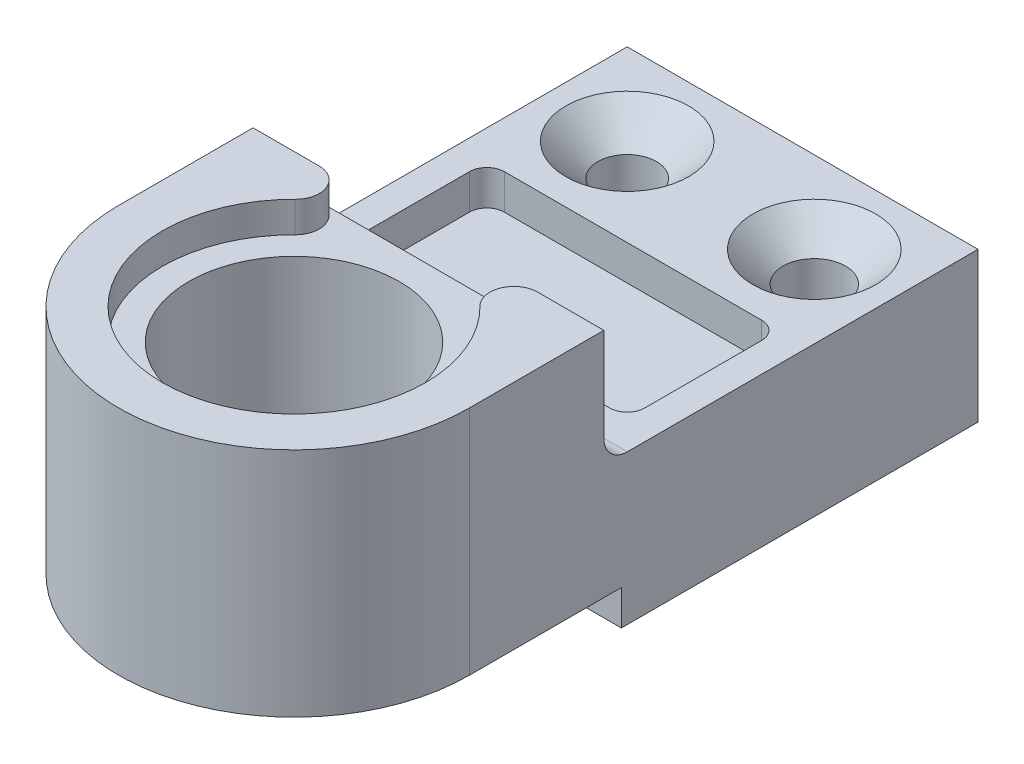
ISO-10303-21;
HEADER;
FILE_DESCRIPTION(('STEP AP214'),'2;1');
FILE_NAME('part.step','',(''),(''),'','','');
FILE_SCHEMA(('AUTOMOTIVE_DESIGN { 1 0 10303 214 1 1 1 1 }'));
ENDSEC;
DATA;
#1=APPLICATION_CONTEXT('core data for automotive mechanical design processes');
#2=APPLICATION_PROTOCOL_DEFINITION('international standard','automotive_design',2000,#1);
#3=PRODUCT_CONTEXT('',#1,'mechanical');
#4=PRODUCT('Part','Part','',(#3));
#5=PRODUCT_RELATED_PRODUCT_CATEGORY('part','',(#4));
#6=PRODUCT_DEFINITION_FORMATION('','',#4);
#7=PRODUCT_DEFINITION_CONTEXT('part definition',#1,'design');
#8=PRODUCT_DEFINITION('design','',#6,#7);
#9=PRODUCT_DEFINITION_SHAPE('','',#8);
#10=(LENGTH_UNIT() NAMED_UNIT(*) SI_UNIT(.MILLI.,.METRE.));
#11=(NAMED_UNIT(*) PLANE_ANGLE_UNIT() SI_UNIT($,.RADIAN.));
#12=(NAMED_UNIT(*) SI_UNIT($,.STERADIAN.) SOLID_ANGLE_UNIT());
#13=UNCERTAINTY_MEASURE_WITH_UNIT(LENGTH_MEASURE(1.E-05),#10,'distance_accuracy_value','');
#14=(GEOMETRIC_REPRESENTATION_CONTEXT(3) GLOBAL_UNCERTAINTY_ASSIGNED_CONTEXT((#13)) GLOBAL_UNIT_ASSIGNED_CONTEXT((#10,
#11,#12)) REPRESENTATION_CONTEXT('',''));
#15=CARTESIAN_POINT('',(0.,0.,0.));
#16=DIRECTION('',(0.,0.,1.));
#17=DIRECTION('',(1.,0.,0.));
#18=AXIS2_PLACEMENT_3D('',#15,#16,#17);
#19=CARTESIAN_POINT('',(0.,0.,0.));
#20=DIRECTION('',(0.,-1.,0.));
#21=DIRECTION('',(0.,0.,-1.));
#22=AXIS2_PLACEMENT_3D('',#19,#20,#21);
#23=CYLINDRICAL_SURFACE('',#22,9.);
#24=CARTESIAN_POINT('',(0.,7.37,0.));
#25=DIRECTION('',(0.,-1.,0.));
#26=DIRECTION('',(0.,0.,-1.));
#27=AXIS2_PLACEMENT_3D('',#24,#25,#26);
#28=CIRCLE('',#27,9.);
#29=CARTESIAN_POINT('',(0.,7.37,-9.));
#30=VERTEX_POINT('',#29);
#31=EDGE_CURVE('E194',#30,#30,#28,.T.);
#32=ORIENTED_EDGE('',*,*,#31,.F.);
#33=EDGE_LOOP('',(#32));
#34=FACE_BOUND('',#33,.T.);
#35=CARTESIAN_POINT('',(0.,-7.17,0.));
#36=DIRECTION('',(0.,-1.,0.));
#37=DIRECTION('',(0.,0.,-1.));
#38=AXIS2_PLACEMENT_3D('',#35,#36,#37);
#39=CIRCLE('',#38,9.);
#40=CARTESIAN_POINT('',(0.,-7.17,-9.));
#41=VERTEX_POINT('',#40);
#42=EDGE_CURVE('E19',#41,#41,#39,.T.);
#43=ORIENTED_EDGE('',*,*,#42,.T.);
#44=EDGE_LOOP('',(#43));
#45=FACE_BOUND('',#44,.T.);
#46=ADVANCED_FACE('F15',(#34,#45),#23,.F.);
#47=CARTESIAN_POINT('',(0.,-3.,-22.5));
#48=DIRECTION('',(0.,1.,0.));
#49=DIRECTION('',(0.,0.,1.));
#50=AXIS2_PLACEMENT_3D('',#47,#48,#49);
#51=PLANE('',#50);
#52=CARTESIAN_POINT('',(-11.,-3.,-27.5));
#53=DIRECTION('',(0.,-1.,0.));
#54=DIRECTION('',(0.,0.,-1.));
#55=AXIS2_PLACEMENT_3D('',#52,#53,#54);
#56=CIRCLE('',#55,1.49999999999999);
#57=CARTESIAN_POINT('',(-11.,-3.,-29.));
#58=VERTEX_POINT('',#57);
#59=CARTESIAN_POINT('',(-12.5,-3.,-27.5));
#60=VERTEX_POINT('',#59);
#61=EDGE_CURVE('E200',#58,#60,#56,.F.);
#62=ORIENTED_EDGE('',*,*,#61,.T.);
#63=DIRECTION('',(0.,0.,1.));
#64=VECTOR('',#63,1.);
#65=CARTESIAN_POINT('',(-12.5,-3.,-27.5));
#66=LINE('',#65,#64);
#67=CARTESIAN_POINT('',(-12.5,-3.,-17.5));
#68=VERTEX_POINT('',#67);
#69=EDGE_CURVE('E197',#60,#68,#66,.T.);
#70=ORIENTED_EDGE('',*,*,#69,.T.);
#71=CARTESIAN_POINT('',(-11.,-3.,-17.5));
#72=DIRECTION('',(0.,-1.,0.));
#73=DIRECTION('',(0.,0.,-1.));
#74=AXIS2_PLACEMENT_3D('',#71,#72,#73);
#75=CIRCLE('',#74,1.50000000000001);
#76=CARTESIAN_POINT('',(-11.,-3.,-16.));
#77=VERTEX_POINT('',#76);
#78=EDGE_CURVE('E183',#68,#77,#75,.F.);
#79=ORIENTED_EDGE('',*,*,#78,.T.);
#80=DIRECTION('',(1.,0.,0.));
#81=VECTOR('',#80,1.);
#82=CARTESIAN_POINT('',(-11.,-3.,-16.));
#83=LINE('',#82,#81);
#84=CARTESIAN_POINT('',(11.,-3.,-16.));
#85=VERTEX_POINT('',#84);
#86=EDGE_CURVE('E235',#77,#85,#83,.T.);
#87=ORIENTED_EDGE('',*,*,#86,.T.);
#88=CARTESIAN_POINT('',(11.,-3.,-17.5));
#89=DIRECTION('',(0.,-1.,0.));
#90=DIRECTION('',(0.,0.,-1.));
#91=AXIS2_PLACEMENT_3D('',#88,#89,#90);
#92=CIRCLE('',#91,1.5);
#93=CARTESIAN_POINT('',(12.5,-3.,-17.5));
#94=VERTEX_POINT('',#93);
#95=EDGE_CURVE('E346',#85,#94,#92,.F.);
#96=ORIENTED_EDGE('',*,*,#95,.T.);
#97=DIRECTION('',(0.,0.,-1.));
#98=VECTOR('',#97,1.);
#99=CARTESIAN_POINT('',(12.5,-3.,-17.5));
#100=LINE('',#99,#98);
#101=CARTESIAN_POINT('',(12.5,-3.,-27.5));
#102=VERTEX_POINT('',#101);
#103=EDGE_CURVE('E238',#94,#102,#100,.T.);
#104=ORIENTED_EDGE('',*,*,#103,.T.);
#105=CARTESIAN_POINT('',(11.,-3.,-27.5));
#106=DIRECTION('',(0.,-1.,0.));
#107=DIRECTION('',(0.,0.,-1.));
#108=AXIS2_PLACEMENT_3D('',#105,#106,#107);
#109=CIRCLE('',#108,1.49999999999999);
#110=CARTESIAN_POINT('',(11.,-3.,-29.));
#111=VERTEX_POINT('',#110);
#112=EDGE_CURVE('E350',#102,#111,#109,.F.);
#113=ORIENTED_EDGE('',*,*,#112,.T.);
#114=DIRECTION('',(-1.,0.,0.));
#115=VECTOR('',#114,1.);
#116=CARTESIAN_POINT('',(11.,-3.,-29.));
#117=LINE('',#116,#115);
#118=EDGE_CURVE('E243',#111,#58,#117,.T.);
#119=ORIENTED_EDGE('',*,*,#118,.T.);
#120=EDGE_LOOP('',(#62,#70,#79,#87,#96,#104,#113,#119));
#121=FACE_BOUND('',#120,.T.);
#122=ADVANCED_FACE('F198',(#121),#51,.T.);
#123=CARTESIAN_POINT('',(0.,-9.80000000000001,-22.5));
#124=DIRECTION('',(0.,1.,0.));
#125=DIRECTION('',(0.,0.,1.));
#126=AXIS2_PLACEMENT_3D('',#123,#124,#125);
#127=PLANE('',#126);
#128=CARTESIAN_POINT('',(-11.,-9.80000000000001,-27.5));
#129=DIRECTION('',(0.,1.,0.));
#130=DIRECTION('',(0.,0.,1.));
#131=AXIS2_PLACEMENT_3D('',#128,#129,#130);
#132=CIRCLE('',#131,1.49999999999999);
#133=CARTESIAN_POINT('',(-12.5,-9.80000000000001,-27.5));
#134=VERTEX_POINT('',#133);
#135=CARTESIAN_POINT('',(-11.,-9.80000000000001,-29.));
#136=VERTEX_POINT('',#135);
#137=EDGE_CURVE('E343',#134,#136,#132,.F.);
#138=ORIENTED_EDGE('',*,*,#137,.T.);
#139=DIRECTION('',(-1.,0.,0.));
#140=VECTOR('',#139,1.);
#141=CARTESIAN_POINT('',(-11.,-9.80000000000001,-29.));
#142=LINE('',#141,#140);
#143=CARTESIAN_POINT('',(11.,-9.80000000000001,-29.));
#144=VERTEX_POINT('',#143);
#145=EDGE_CURVE('E231',#136,#144,#142,.F.);
#146=ORIENTED_EDGE('',*,*,#145,.T.);
#147=CARTESIAN_POINT('',(11.,-9.80000000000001,-27.5));
#148=DIRECTION('',(0.,1.,0.));
#149=DIRECTION('',(0.,0.,1.));
#150=AXIS2_PLACEMENT_3D('',#147,#148,#149);
#151=CIRCLE('',#150,1.49999999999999);
#152=CARTESIAN_POINT('',(12.5,-9.80000000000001,-27.5));
#153=VERTEX_POINT('',#152);
#154=EDGE_CURVE('E341',#144,#153,#151,.F.);
#155=ORIENTED_EDGE('',*,*,#154,.T.);
#156=DIRECTION('',(0.,0.,-1.));
#157=VECTOR('',#156,1.);
#158=CARTESIAN_POINT('',(12.5,-9.80000000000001,-27.5));
#159=LINE('',#158,#157);
#160=CARTESIAN_POINT('',(12.5,-9.80000000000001,-17.5));
#161=VERTEX_POINT('',#160);
#162=EDGE_CURVE('E227',#153,#161,#159,.F.);
#163=ORIENTED_EDGE('',*,*,#162,.T.);
#164=CARTESIAN_POINT('',(11.,-9.80000000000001,-17.5));
#165=DIRECTION('',(0.,1.,0.));
#166=DIRECTION('',(0.,0.,1.));
#167=AXIS2_PLACEMENT_3D('',#164,#165,#166);
#168=CIRCLE('',#167,1.5);
#169=CARTESIAN_POINT('',(11.,-9.80000000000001,-16.));
#170=VERTEX_POINT('',#169);
#171=EDGE_CURVE('E339',#161,#170,#168,.F.);
#172=ORIENTED_EDGE('',*,*,#171,.T.);
#173=DIRECTION('',(1.,0.,0.));
#174=VECTOR('',#173,1.);
#175=CARTESIAN_POINT('',(11.,-9.80000000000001,-16.));
#176=LINE('',#175,#174);
#177=CARTESIAN_POINT('',(-11.,-9.80000000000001,-16.));
#178=VERTEX_POINT('',#177);
#179=EDGE_CURVE('E223',#170,#178,#176,.F.);
#180=ORIENTED_EDGE('',*,*,#179,.T.);
#181=CARTESIAN_POINT('',(-11.,-9.80000000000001,-17.5));
#182=DIRECTION('',(0.,1.,0.));
#183=DIRECTION('',(0.,0.,1.));
#184=AXIS2_PLACEMENT_3D('',#181,#182,#183);
#185=CIRCLE('',#184,1.50000000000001);
#186=CARTESIAN_POINT('',(-12.5,-9.80000000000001,-17.5));
#187=VERTEX_POINT('',#186);
#188=EDGE_CURVE('E336',#178,#187,#185,.F.);
#189=ORIENTED_EDGE('',*,*,#188,.T.);
#190=DIRECTION('',(0.,0.,1.));
#191=VECTOR('',#190,1.);
#192=CARTESIAN_POINT('',(-12.5,-9.80000000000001,-17.5));
#193=LINE('',#192,#191);
#194=EDGE_CURVE('E218',#187,#134,#193,.F.);
#195=ORIENTED_EDGE('',*,*,#194,.T.);
#196=EDGE_LOOP('',(#138,#146,#155,#163,#172,#180,#189,#195));
#197=FACE_BOUND('',#196,.T.);
#198=ADVANCED_FACE('F598',(#197),#127,.F.);
#199=CARTESIAN_POINT('',(-8.,0.,-36.5));
#200=DIRECTION('',(0.,-1.,0.));
#201=DIRECTION('',(0.,0.,-1.));
#202=AXIS2_PLACEMENT_3D('',#199,#200,#201);
#203=CYLINDRICAL_SURFACE('',#202,2.50227702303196);
#204=CARTESIAN_POINT('',(-8.,-2.74772297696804,-36.5));
#205=DIRECTION('',(0.,1.,0.));
#206=DIRECTION('',(0.,0.,1.));
#207=AXIS2_PLACEMENT_3D('',#204,#205,#206);
#208=CIRCLE('',#207,2.50227702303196);
#209=CARTESIAN_POINT('',(-8.,-2.74772297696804,-33.997722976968));
#210=VERTEX_POINT('',#209);
#211=EDGE_CURVE('E345',#210,#210,#208,.T.);
#212=ORIENTED_EDGE('',*,*,#211,.T.);
#213=EDGE_LOOP('',(#212));
#214=FACE_BOUND('',#213,.T.);
#215=CARTESIAN_POINT('',(-8.,-10.052277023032,-36.5));
#216=DIRECTION('',(0.,-1.,0.));
#217=DIRECTION('',(1.,0.,0.));
#218=AXIS2_PLACEMENT_3D('',#215,#216,#217);
#219=CIRCLE('',#218,2.50227702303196);
#220=CARTESIAN_POINT('',(-5.49772297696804,-10.052277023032,-36.5));
#221=VERTEX_POINT('',#220);
#222=EDGE_CURVE('E221',#221,#221,#219,.T.);
#223=ORIENTED_EDGE('',*,*,#222,.T.);
#224=EDGE_LOOP('',(#223));
#225=FACE_BOUND('',#224,.T.);
#226=ADVANCED_FACE('F594',(#214,#225),#203,.F.);
#227=CARTESIAN_POINT('',(8.,0.,-36.5));
#228=DIRECTION('',(0.,-1.,0.));
#229=DIRECTION('',(0.,0.,-1.));
#230=AXIS2_PLACEMENT_3D('',#227,#228,#229);
#231=CYLINDRICAL_SURFACE('',#230,2.67376518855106);
#232=CARTESIAN_POINT('',(8.,-2.57623481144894,-36.5));
#233=DIRECTION('',(0.,1.,0.));
#234=DIRECTION('',(0.,0.,1.));
#235=AXIS2_PLACEMENT_3D('',#232,#233,#234);
#236=CIRCLE('',#235,2.67376518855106);
#237=CARTESIAN_POINT('',(8.,-2.57623481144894,-33.8262348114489));
#238=VERTEX_POINT('',#237);
#239=EDGE_CURVE('E237',#238,#238,#236,.T.);
#240=ORIENTED_EDGE('',*,*,#239,.T.);
#241=EDGE_LOOP('',(#240));
#242=FACE_BOUND('',#241,.T.);
#243=CARTESIAN_POINT('',(8.,-10.2237651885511,-36.5));
#244=DIRECTION('',(0.,-1.,0.));
#245=DIRECTION('',(0.,0.,-1.));
#246=AXIS2_PLACEMENT_3D('',#243,#244,#245);
#247=CIRCLE('',#246,2.67376518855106);
#248=CARTESIAN_POINT('',(8.,-10.2237651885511,-39.1737651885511));
#249=VERTEX_POINT('',#248);
#250=EDGE_CURVE('E335',#249,#249,#247,.T.);
#251=ORIENTED_EDGE('',*,*,#250,.T.);
#252=EDGE_LOOP('',(#251));
#253=FACE_BOUND('',#252,.T.);
#254=ADVANCED_FACE('F364',(#242,#253),#231,.F.);
#255=CARTESIAN_POINT('',(0.,-7.17,0.));
#256=DIRECTION('',(0.,1.,0.));
#257=DIRECTION('',(0.,0.,1.));
#258=AXIS2_PLACEMENT_3D('',#255,#256,#257);
#259=PLANE('',#258);
#260=ORIENTED_EDGE('',*,*,#42,.F.);
#261=EDGE_LOOP('',(#260));
#262=FACE_BOUND('',#261,.T.);
#263=CARTESIAN_POINT('',(0.,-7.17,0.));
#264=DIRECTION('',(0.,1.,0.));
#265=DIRECTION('',(0.,0.,1.));
#266=AXIS2_PLACEMENT_3D('',#263,#264,#265);
#267=CIRCLE('',#266,11.25);
#268=CARTESIAN_POINT('',(0.,-7.17,11.25));
#269=VERTEX_POINT('',#268);
#270=EDGE_CURVE('E332',#269,#269,#267,.F.);
#271=ORIENTED_EDGE('',*,*,#270,.T.);
#272=EDGE_LOOP('',(#271));
#273=FACE_BOUND('',#272,.T.);
#274=ADVANCED_FACE('F360',(#262,#273),#259,.F.);
#275=CARTESIAN_POINT('',(0.,7.37,-2.35276534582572));
#276=DIRECTION('',(0.,1.,0.));
#277=DIRECTION('',(0.,0.,1.));
#278=AXIS2_PLACEMENT_3D('',#275,#276,#277);
#279=PLANE('',#278);
#280=ORIENTED_EDGE('',*,*,#31,.T.);
#281=EDGE_LOOP('',(#280));
#282=FACE_BOUND('',#281,.T.);
#283=DIRECTION('',(-1.,0.,0.));
#284=VECTOR('',#283,1.);
#285=CARTESIAN_POINT('',(-15.,7.37,-11.5));
#286=LINE('',#285,#284);
#287=CARTESIAN_POINT('',(-9.34384469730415,7.37,-11.5));
#288=VERTEX_POINT('',#287);
#289=CARTESIAN_POINT('',(9.34384469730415,7.37,-11.5));
#290=VERTEX_POINT('',#289);
#291=EDGE_CURVE('E213',#288,#290,#286,.F.);
#292=ORIENTED_EDGE('',*,*,#291,.F.);
#293=CARTESIAN_POINT('',(-9.34384469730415,7.37,-9.45615530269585));
#294=DIRECTION('',(0.,-1.,0.));
#295=DIRECTION('',(0.,0.,-1.));
#296=AXIS2_PLACEMENT_3D('',#293,#294,#295);
#297=CIRCLE('',#296,2.04384469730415);
#298=CARTESIAN_POINT('',(-7.90728756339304,7.37,-8.00233112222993));
#299=VERTEX_POINT('',#298);
#300=EDGE_CURVE('E330',#299,#288,#297,.F.);
#301=ORIENTED_EDGE('',*,*,#300,.F.);
#302=CARTESIAN_POINT('',(0.,7.37,0.));
#303=DIRECTION('',(0.,-1.,0.));
#304=DIRECTION('',(0.,0.,-1.));
#305=AXIS2_PLACEMENT_3D('',#302,#303,#304);
#306=CIRCLE('',#305,11.25);
#307=CARTESIAN_POINT('',(7.90728756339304,7.37,-8.00233112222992));
#308=VERTEX_POINT('',#307);
#309=EDGE_CURVE('E323',#299,#308,#306,.F.);
#310=ORIENTED_EDGE('',*,*,#309,.T.);
#311=CARTESIAN_POINT('',(9.34384469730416,7.37,-9.45615530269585));
#312=DIRECTION('',(0.,-1.,0.));
#313=DIRECTION('',(0.,0.,-1.));
#314=AXIS2_PLACEMENT_3D('',#311,#312,#313);
#315=CIRCLE('',#314,2.04384469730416);
#316=EDGE_CURVE('E327',#290,#308,#315,.F.);
#317=ORIENTED_EDGE('',*,*,#316,.F.);
#318=EDGE_LOOP('',(#292,#301,#310,#317));
#319=FACE_BOUND('',#318,.T.);
#320=ADVANCED_FACE('F363',(#282,#319),#279,.T.);
#321=CARTESIAN_POINT('',(-11.,0.,-17.5));
#322=DIRECTION('',(0.,-1.,0.));
#323=DIRECTION('',(0.,0.,-1.));
#324=AXIS2_PLACEMENT_3D('',#321,#322,#323);
#325=CYLINDRICAL_SURFACE('',#324,1.50000000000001);
#326=DIRECTION('',(0.,1.,0.));
#327=VECTOR('',#326,1.);
#328=CARTESIAN_POINT('',(-12.5,0.,-17.5));
#329=LINE('',#328,#327);
#330=CARTESIAN_POINT('',(-12.5,0.,-17.5));
#331=VERTEX_POINT('',#330);
#332=EDGE_CURVE('E187',#68,#331,#329,.T.);
#333=ORIENTED_EDGE('',*,*,#332,.T.);
#334=CARTESIAN_POINT('',(-11.,0.,-17.5));
#335=DIRECTION('',(0.,-1.,0.));
#336=DIRECTION('',(0.,0.,-1.));
#337=AXIS2_PLACEMENT_3D('',#334,#335,#336);
#338=CIRCLE('',#337,1.50000000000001);
#339=CARTESIAN_POINT('',(-11.,0.,-16.));
#340=VERTEX_POINT('',#339);
#341=EDGE_CURVE('E320',#340,#331,#338,.T.);
#342=ORIENTED_EDGE('',*,*,#341,.F.);
#343=DIRECTION('',(0.,1.,0.));
#344=VECTOR('',#343,1.);
#345=CARTESIAN_POINT('',(-11.,0.,-16.));
#346=LINE('',#345,#344);
#347=EDGE_CURVE('E190',#340,#77,#346,.F.);
#348=ORIENTED_EDGE('',*,*,#347,.T.);
#349=ORIENTED_EDGE('',*,*,#78,.F.);
#350=EDGE_LOOP('',(#333,#342,#348,#349));
#351=FACE_BOUND('',#350,.T.);
#352=ADVANCED_FACE('F185',(#351),#325,.F.);
#353=CARTESIAN_POINT('',(-12.5,0.,-27.5));
#354=DIRECTION('',(-1.,0.,0.));
#355=DIRECTION('',(0.,0.,1.));
#356=AXIS2_PLACEMENT_3D('',#353,#354,#355);
#357=PLANE('',#356);
#358=DIRECTION('',(0.,-1.,0.));
#359=VECTOR('',#358,1.);
#360=CARTESIAN_POINT('',(-12.5,0.,-27.5));
#361=LINE('',#360,#359);
#362=CARTESIAN_POINT('',(-12.5,0.,-27.5));
#363=VERTEX_POINT('',#362);
#364=EDGE_CURVE('E203',#60,#363,#361,.F.);
#365=ORIENTED_EDGE('',*,*,#364,.T.);
#366=DIRECTION('',(0.,0.,1.));
#367=VECTOR('',#366,1.);
#368=CARTESIAN_POINT('',(-12.5,0.,-17.0086711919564));
#369=LINE('',#368,#367);
#370=EDGE_CURVE('E207',#331,#363,#369,.F.);
#371=ORIENTED_EDGE('',*,*,#370,.F.);
#372=ORIENTED_EDGE('',*,*,#332,.F.);
#373=ORIENTED_EDGE('',*,*,#69,.F.);
#374=EDGE_LOOP('',(#365,#371,#372,#373));
#375=FACE_BOUND('',#374,.T.);
#376=ADVANCED_FACE('F205',(#375),#357,.F.);
#377=CARTESIAN_POINT('',(-11.,0.,-27.5));
#378=DIRECTION('',(0.,-1.,0.));
#379=DIRECTION('',(0.,0.,-1.));
#380=AXIS2_PLACEMENT_3D('',#377,#378,#379);
#381=CYLINDRICAL_SURFACE('',#380,1.49999999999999);
#382=DIRECTION('',(0.,1.,0.));
#383=VECTOR('',#382,1.);
#384=CARTESIAN_POINT('',(-11.,0.,-29.));
#385=LINE('',#384,#383);
#386=CARTESIAN_POINT('',(-11.,0.,-29.));
#387=VERTEX_POINT('',#386);
#388=EDGE_CURVE('E245',#58,#387,#385,.T.);
#389=ORIENTED_EDGE('',*,*,#388,.T.);
#390=CARTESIAN_POINT('',(-11.,0.,-27.5));
#391=DIRECTION('',(0.,-1.,0.));
#392=DIRECTION('',(0.,0.,-1.));
#393=AXIS2_PLACEMENT_3D('',#390,#391,#392);
#394=CIRCLE('',#393,1.49999999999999);
#395=EDGE_CURVE('E317',#363,#387,#394,.T.);
#396=ORIENTED_EDGE('',*,*,#395,.F.);
#397=ORIENTED_EDGE('',*,*,#364,.F.);
#398=ORIENTED_EDGE('',*,*,#61,.F.);
#399=EDGE_LOOP('',(#389,#396,#397,#398));
#400=FACE_BOUND('',#399,.T.);
#401=ADVANCED_FACE('F552',(#400),#381,.F.);
#402=CARTESIAN_POINT('',(11.,0.,-29.));
#403=DIRECTION('',(0.,0.,-1.));
#404=DIRECTION('',(-1.,0.,0.));
#405=AXIS2_PLACEMENT_3D('',#402,#403,#404);
#406=PLANE('',#405);
#407=DIRECTION('',(0.,-1.,0.));
#408=VECTOR('',#407,1.);
#409=CARTESIAN_POINT('',(11.,0.,-29.));
#410=LINE('',#409,#408);
#411=CARTESIAN_POINT('',(11.,0.,-29.));
#412=VERTEX_POINT('',#411);
#413=EDGE_CURVE('E244',#111,#412,#410,.F.);
#414=ORIENTED_EDGE('',*,*,#413,.T.);
#415=DIRECTION('',(1.,0.,0.));
#416=VECTOR('',#415,1.);
#417=CARTESIAN_POINT('',(0.,0.,-29.));
#418=LINE('',#417,#416);
#419=EDGE_CURVE('E316',#387,#412,#418,.T.);
#420=ORIENTED_EDGE('',*,*,#419,.F.);
#421=ORIENTED_EDGE('',*,*,#388,.F.);
#422=ORIENTED_EDGE('',*,*,#118,.F.);
#423=EDGE_LOOP('',(#414,#420,#421,#422));
#424=FACE_BOUND('',#423,.T.);
#425=ADVANCED_FACE('F554',(#424),#406,.F.);
#426=CARTESIAN_POINT('',(11.,0.,-27.5));
#427=DIRECTION('',(0.,-1.,0.));
#428=DIRECTION('',(0.,0.,-1.));
#429=AXIS2_PLACEMENT_3D('',#426,#427,#428);
#430=CYLINDRICAL_SURFACE('',#429,1.49999999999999);
#431=DIRECTION('',(0.,1.,0.));
#432=VECTOR('',#431,1.);
#433=CARTESIAN_POINT('',(12.5,0.,-27.5));
#434=LINE('',#433,#432);
#435=CARTESIAN_POINT('',(12.5,0.,-27.5));
#436=VERTEX_POINT('',#435);
#437=EDGE_CURVE('E242',#102,#436,#434,.T.);
#438=ORIENTED_EDGE('',*,*,#437,.T.);
#439=CARTESIAN_POINT('',(11.,0.,-27.5));
#440=DIRECTION('',(0.,-1.,0.));
#441=DIRECTION('',(0.,0.,-1.));
#442=AXIS2_PLACEMENT_3D('',#439,#440,#441);
#443=CIRCLE('',#442,1.49999999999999);
#444=EDGE_CURVE('E313',#412,#436,#443,.T.);
#445=ORIENTED_EDGE('',*,*,#444,.F.);
#446=ORIENTED_EDGE('',*,*,#413,.F.);
#447=ORIENTED_EDGE('',*,*,#112,.F.);
#448=EDGE_LOOP('',(#438,#445,#446,#447));
#449=FACE_BOUND('',#448,.T.);
#450=ADVANCED_FACE('F572',(#449),#430,.F.);
#451=CARTESIAN_POINT('',(12.5,0.,-17.5));
#452=DIRECTION('',(1.,0.,0.));
#453=DIRECTION('',(0.,0.,-1.));
#454=AXIS2_PLACEMENT_3D('',#451,#452,#453);
#455=PLANE('',#454);
#456=DIRECTION('',(0.,-1.,0.));
#457=VECTOR('',#456,1.);
#458=CARTESIAN_POINT('',(12.5,0.,-17.5));
#459=LINE('',#458,#457);
#460=CARTESIAN_POINT('',(12.5,0.,-17.5));
#461=VERTEX_POINT('',#460);
#462=EDGE_CURVE('E241',#94,#461,#459,.F.);
#463=ORIENTED_EDGE('',*,*,#462,.T.);
#464=DIRECTION('',(0.,0.,1.));
#465=VECTOR('',#464,1.);
#466=CARTESIAN_POINT('',(12.5,0.,-17.0086711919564));
#467=LINE('',#466,#465);
#468=EDGE_CURVE('E312',#436,#461,#467,.T.);
#469=ORIENTED_EDGE('',*,*,#468,.F.);
#470=ORIENTED_EDGE('',*,*,#437,.F.);
#471=ORIENTED_EDGE('',*,*,#103,.F.);
#472=EDGE_LOOP('',(#463,#469,#470,#471));
#473=FACE_BOUND('',#472,.T.);
#474=ADVANCED_FACE('F570',(#473),#455,.F.);
#475=CARTESIAN_POINT('',(11.,0.,-17.5));
#476=DIRECTION('',(0.,-1.,0.));
#477=DIRECTION('',(0.,0.,-1.));
#478=AXIS2_PLACEMENT_3D('',#475,#476,#477);
#479=CYLINDRICAL_SURFACE('',#478,1.5);
#480=DIRECTION('',(0.,1.,0.));
#481=VECTOR('',#480,1.);
#482=CARTESIAN_POINT('',(11.,0.,-16.));
#483=LINE('',#482,#481);
#484=CARTESIAN_POINT('',(11.,0.,-16.));
#485=VERTEX_POINT('',#484);
#486=EDGE_CURVE('E349',#85,#485,#483,.T.);
#487=ORIENTED_EDGE('',*,*,#486,.T.);
#488=CARTESIAN_POINT('',(11.,0.,-17.5));
#489=DIRECTION('',(0.,-1.,0.));
#490=DIRECTION('',(0.,0.,-1.));
#491=AXIS2_PLACEMENT_3D('',#488,#489,#490);
#492=CIRCLE('',#491,1.5);
#493=EDGE_CURVE('E309',#461,#485,#492,.T.);
#494=ORIENTED_EDGE('',*,*,#493,.F.);
#495=ORIENTED_EDGE('',*,*,#462,.F.);
#496=ORIENTED_EDGE('',*,*,#95,.F.);
#497=EDGE_LOOP('',(#487,#494,#495,#496));
#498=FACE_BOUND('',#497,.T.);
#499=ADVANCED_FACE('F567',(#498),#479,.F.);
#500=CARTESIAN_POINT('',(-11.,0.,-16.));
#501=DIRECTION('',(0.,0.,1.));
#502=DIRECTION('',(1.,0.,0.));
#503=AXIS2_PLACEMENT_3D('',#500,#501,#502);
#504=PLANE('',#503);
#505=ORIENTED_EDGE('',*,*,#347,.F.);
#506=DIRECTION('',(1.,0.,0.));
#507=VECTOR('',#506,1.);
#508=CARTESIAN_POINT('',(0.,0.,-16.));
#509=LINE('',#508,#507);
#510=EDGE_CURVE('E308',#485,#340,#509,.F.);
#511=ORIENTED_EDGE('',*,*,#510,.F.);
#512=ORIENTED_EDGE('',*,*,#486,.F.);
#513=ORIENTED_EDGE('',*,*,#86,.F.);
#514=EDGE_LOOP('',(#505,#511,#512,#513));
#515=FACE_BOUND('',#514,.T.);
#516=ADVANCED_FACE('F561',(#515),#504,.F.);
#517=CARTESIAN_POINT('',(8.,0.,-36.5));
#518=DIRECTION('',(0.,1.,0.));
#519=DIRECTION('',(0.,0.,1.));
#520=AXIS2_PLACEMENT_3D('',#517,#518,#519);
#521=CONICAL_SURFACE('',#520,5.25,0.785398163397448);
#522=CARTESIAN_POINT('',(8.,0.,-36.5));
#523=DIRECTION('',(0.,1.,0.));
#524=DIRECTION('',(0.,0.,1.));
#525=AXIS2_PLACEMENT_3D('',#522,#523,#524);
#526=CIRCLE('',#525,5.25);
#527=CARTESIAN_POINT('',(8.,0.,-31.25));
#528=VERTEX_POINT('',#527);
#529=EDGE_CURVE('E305',#528,#528,#526,.F.);
#530=ORIENTED_EDGE('',*,*,#529,.F.);
#531=EDGE_LOOP('',(#530));
#532=FACE_BOUND('',#531,.T.);
#533=ORIENTED_EDGE('',*,*,#239,.F.);
#534=EDGE_LOOP('',(#533));
#535=FACE_BOUND('',#534,.T.);
#536=ADVANCED_FACE('F608',(#532,#535),#521,.F.);
#537=CARTESIAN_POINT('',(-8.,0.,-36.5));
#538=DIRECTION('',(0.,1.,0.));
#539=DIRECTION('',(0.,0.,1.));
#540=AXIS2_PLACEMENT_3D('',#537,#538,#539);
#541=CONICAL_SURFACE('',#540,5.25,0.785398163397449);
#542=CARTESIAN_POINT('',(-8.,0.,-36.5));
#543=DIRECTION('',(0.,1.,0.));
#544=DIRECTION('',(0.,0.,1.));
#545=AXIS2_PLACEMENT_3D('',#542,#543,#544);
#546=CIRCLE('',#545,5.25);
#547=CARTESIAN_POINT('',(-8.,0.,-31.25));
#548=VERTEX_POINT('',#547);
#549=EDGE_CURVE('E301',#548,#548,#546,.F.);
#550=ORIENTED_EDGE('',*,*,#549,.F.);
#551=EDGE_LOOP('',(#550));
#552=FACE_BOUND('',#551,.T.);
#553=ORIENTED_EDGE('',*,*,#211,.F.);
#554=EDGE_LOOP('',(#553));
#555=FACE_BOUND('',#554,.T.);
#556=ADVANCED_FACE('F611',(#552,#555),#541,.F.);
#557=CARTESIAN_POINT('',(-11.,-12.8,-27.5));
#558=DIRECTION('',(0.,1.,0.));
#559=DIRECTION('',(0.,0.,1.));
#560=AXIS2_PLACEMENT_3D('',#557,#558,#559);
#561=CYLINDRICAL_SURFACE('',#560,1.49999999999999);
#562=DIRECTION('',(0.,1.,0.));
#563=VECTOR('',#562,1.);
#564=CARTESIAN_POINT('',(-12.5,-12.8,-27.5));
#565=LINE('',#564,#563);
#566=CARTESIAN_POINT('',(-12.5,-12.8,-27.5));
#567=VERTEX_POINT('',#566);
#568=EDGE_CURVE('E338',#134,#567,#565,.F.);
#569=ORIENTED_EDGE('',*,*,#568,.T.);
#570=CARTESIAN_POINT('',(-11.,-12.8,-27.5));
#571=DIRECTION('',(0.,1.,0.));
#572=DIRECTION('',(0.,0.,1.));
#573=AXIS2_PLACEMENT_3D('',#570,#571,#572);
#574=CIRCLE('',#573,1.49999999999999);
#575=CARTESIAN_POINT('',(-11.,-12.8,-29.));
#576=VERTEX_POINT('',#575);
#577=EDGE_CURVE('E298',#567,#576,#574,.F.);
#578=ORIENTED_EDGE('',*,*,#577,.T.);
#579=DIRECTION('',(0.,1.,0.));
#580=VECTOR('',#579,1.);
#581=CARTESIAN_POINT('',(-11.,-12.8,-29.));
#582=LINE('',#581,#580);
#583=EDGE_CURVE('E234',#576,#136,#582,.T.);
#584=ORIENTED_EDGE('',*,*,#583,.T.);
#585=ORIENTED_EDGE('',*,*,#137,.F.);
#586=EDGE_LOOP('',(#569,#578,#584,#585));
#587=FACE_BOUND('',#586,.T.);
#588=ADVANCED_FACE('F614',(#587),#561,.F.);
#589=CARTESIAN_POINT('',(-11.,-12.8,-29.));
#590=DIRECTION('',(0.,0.,-1.));
#591=DIRECTION('',(-1.,0.,0.));
#592=AXIS2_PLACEMENT_3D('',#589,#590,#591);
#593=PLANE('',#592);
#594=ORIENTED_EDGE('',*,*,#583,.F.);
#595=DIRECTION('',(1.,0.,0.));
#596=VECTOR('',#595,1.);
#597=CARTESIAN_POINT('',(0.,-12.8,-29.));
#598=LINE('',#597,#596);
#599=CARTESIAN_POINT('',(11.,-12.8,-29.));
#600=VERTEX_POINT('',#599);
#601=EDGE_CURVE('E297',#576,#600,#598,.T.);
#602=ORIENTED_EDGE('',*,*,#601,.T.);
#603=DIRECTION('',(0.,1.,0.));
#604=VECTOR('',#603,1.);
#605=CARTESIAN_POINT('',(11.,-12.8,-29.));
#606=LINE('',#605,#604);
#607=EDGE_CURVE('E233',#600,#144,#606,.T.);
#608=ORIENTED_EDGE('',*,*,#607,.T.);
#609=ORIENTED_EDGE('',*,*,#145,.F.);
#610=EDGE_LOOP('',(#594,#602,#608,#609));
#611=FACE_BOUND('',#610,.T.);
#612=ADVANCED_FACE('F702',(#611),#593,.F.);
#613=CARTESIAN_POINT('',(11.,-12.8,-27.5));
#614=DIRECTION('',(0.,1.,0.));
#615=DIRECTION('',(0.,0.,1.));
#616=AXIS2_PLACEMENT_3D('',#613,#614,#615);
#617=CYLINDRICAL_SURFACE('',#616,1.49999999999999);
#618=ORIENTED_EDGE('',*,*,#607,.F.);
#619=CARTESIAN_POINT('',(11.,-12.8,-27.5));
#620=DIRECTION('',(0.,1.,0.));
#621=DIRECTION('',(0.,0.,1.));
#622=AXIS2_PLACEMENT_3D('',#619,#620,#621);
#623=CIRCLE('',#622,1.49999999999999);
#624=CARTESIAN_POINT('',(12.5,-12.8,-27.5));
#625=VERTEX_POINT('',#624);
#626=EDGE_CURVE('E295',#600,#625,#623,.F.);
#627=ORIENTED_EDGE('',*,*,#626,.T.);
#628=DIRECTION('',(0.,1.,0.));
#629=VECTOR('',#628,1.);
#630=CARTESIAN_POINT('',(12.5,-12.8,-27.5));
#631=LINE('',#630,#629);
#632=EDGE_CURVE('E230',#625,#153,#631,.T.);
#633=ORIENTED_EDGE('',*,*,#632,.T.);
#634=ORIENTED_EDGE('',*,*,#154,.F.);
#635=EDGE_LOOP('',(#618,#627,#633,#634));
#636=FACE_BOUND('',#635,.T.);
#637=ADVANCED_FACE('F698',(#636),#617,.F.);
#638=CARTESIAN_POINT('',(12.5,-12.8,-27.5));
#639=DIRECTION('',(1.,0.,0.));
#640=DIRECTION('',(0.,0.,-1.));
#641=AXIS2_PLACEMENT_3D('',#638,#639,#640);
#642=PLANE('',#641);
#643=ORIENTED_EDGE('',*,*,#632,.F.);
#644=DIRECTION('',(0.,0.,1.));
#645=VECTOR('',#644,1.);
#646=CARTESIAN_POINT('',(12.5,-12.8,-17.0086711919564));
#647=LINE('',#646,#645);
#648=CARTESIAN_POINT('',(12.5,-12.8,-17.5));
#649=VERTEX_POINT('',#648);
#650=EDGE_CURVE('E294',#625,#649,#647,.T.);
#651=ORIENTED_EDGE('',*,*,#650,.T.);
#652=DIRECTION('',(0.,1.,0.));
#653=VECTOR('',#652,1.);
#654=CARTESIAN_POINT('',(12.5,-12.8,-17.5));
#655=LINE('',#654,#653);
#656=EDGE_CURVE('E229',#649,#161,#655,.T.);
#657=ORIENTED_EDGE('',*,*,#656,.T.);
#658=ORIENTED_EDGE('',*,*,#162,.F.);
#659=EDGE_LOOP('',(#643,#651,#657,#658));
#660=FACE_BOUND('',#659,.T.);
#661=ADVANCED_FACE('F693',(#660),#642,.F.);
#662=CARTESIAN_POINT('',(11.,-12.8,-17.5));
#663=DIRECTION('',(0.,1.,0.));
#664=DIRECTION('',(0.,0.,1.));
#665=AXIS2_PLACEMENT_3D('',#662,#663,#664);
#666=CYLINDRICAL_SURFACE('',#665,1.5);
#667=ORIENTED_EDGE('',*,*,#656,.F.);
#668=CARTESIAN_POINT('',(11.,-12.8,-17.5));
#669=DIRECTION('',(0.,1.,0.));
#670=DIRECTION('',(0.,0.,1.));
#671=AXIS2_PLACEMENT_3D('',#668,#669,#670);
#672=CIRCLE('',#671,1.5);
#673=CARTESIAN_POINT('',(11.,-12.8,-16.));
#674=VERTEX_POINT('',#673);
#675=EDGE_CURVE('E292',#649,#674,#672,.F.);
#676=ORIENTED_EDGE('',*,*,#675,.T.);
#677=DIRECTION('',(0.,1.,0.));
#678=VECTOR('',#677,1.);
#679=CARTESIAN_POINT('',(11.,-12.8,-16.));
#680=LINE('',#679,#678);
#681=EDGE_CURVE('E226',#674,#170,#680,.T.);
#682=ORIENTED_EDGE('',*,*,#681,.T.);
#683=ORIENTED_EDGE('',*,*,#171,.F.);
#684=EDGE_LOOP('',(#667,#676,#682,#683));
#685=FACE_BOUND('',#684,.T.);
#686=ADVANCED_FACE('F687',(#685),#666,.F.);
#687=CARTESIAN_POINT('',(11.,-12.8,-16.));
#688=DIRECTION('',(0.,0.,1.));
#689=DIRECTION('',(1.,0.,0.));
#690=AXIS2_PLACEMENT_3D('',#687,#688,#689);
#691=PLANE('',#690);
#692=ORIENTED_EDGE('',*,*,#681,.F.);
#693=DIRECTION('',(1.,0.,0.));
#694=VECTOR('',#693,1.);
#695=CARTESIAN_POINT('',(0.,-12.8,-16.));
#696=LINE('',#695,#694);
#697=CARTESIAN_POINT('',(-11.,-12.8,-16.));
#698=VERTEX_POINT('',#697);
#699=EDGE_CURVE('E291',#674,#698,#696,.F.);
#700=ORIENTED_EDGE('',*,*,#699,.T.);
#701=DIRECTION('',(0.,1.,0.));
#702=VECTOR('',#701,1.);
#703=CARTESIAN_POINT('',(-11.,-12.8,-16.));
#704=LINE('',#703,#702);
#705=EDGE_CURVE('E225',#698,#178,#704,.T.);
#706=ORIENTED_EDGE('',*,*,#705,.T.);
#707=ORIENTED_EDGE('',*,*,#179,.F.);
#708=EDGE_LOOP('',(#692,#700,#706,#707));
#709=FACE_BOUND('',#708,.T.);
#710=ADVANCED_FACE('F684',(#709),#691,.F.);
#711=CARTESIAN_POINT('',(-11.,-12.8,-17.5));
#712=DIRECTION('',(0.,1.,0.));
#713=DIRECTION('',(0.,0.,1.));
#714=AXIS2_PLACEMENT_3D('',#711,#712,#713);
#715=CYLINDRICAL_SURFACE('',#714,1.50000000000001);
#716=ORIENTED_EDGE('',*,*,#705,.F.);
#717=CARTESIAN_POINT('',(-11.,-12.8,-17.5));
#718=DIRECTION('',(0.,1.,0.));
#719=DIRECTION('',(0.,0.,1.));
#720=AXIS2_PLACEMENT_3D('',#717,#718,#719);
#721=CIRCLE('',#720,1.50000000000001);
#722=CARTESIAN_POINT('',(-12.5,-12.8,-17.5));
#723=VERTEX_POINT('',#722);
#724=EDGE_CURVE('E289',#698,#723,#721,.F.);
#725=ORIENTED_EDGE('',*,*,#724,.T.);
#726=DIRECTION('',(0.,1.,0.));
#727=VECTOR('',#726,1.);
#728=CARTESIAN_POINT('',(-12.5,-12.8,-17.5));
#729=LINE('',#728,#727);
#730=EDGE_CURVE('E222',#723,#187,#729,.T.);
#731=ORIENTED_EDGE('',*,*,#730,.T.);
#732=ORIENTED_EDGE('',*,*,#188,.F.);
#733=EDGE_LOOP('',(#716,#725,#731,#732));
#734=FACE_BOUND('',#733,.T.);
#735=ADVANCED_FACE('F623',(#734),#715,.F.);
#736=CARTESIAN_POINT('',(-12.5,-12.8,-17.5));
#737=DIRECTION('',(-1.,0.,0.));
#738=DIRECTION('',(0.,0.,1.));
#739=AXIS2_PLACEMENT_3D('',#736,#737,#738);
#740=PLANE('',#739);
#741=ORIENTED_EDGE('',*,*,#730,.F.);
#742=DIRECTION('',(0.,0.,1.));
#743=VECTOR('',#742,1.);
#744=CARTESIAN_POINT('',(-12.5,-12.8,-17.0086711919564));
#745=LINE('',#744,#743);
#746=EDGE_CURVE('E288',#723,#567,#745,.F.);
#747=ORIENTED_EDGE('',*,*,#746,.T.);
#748=ORIENTED_EDGE('',*,*,#568,.F.);
#749=ORIENTED_EDGE('',*,*,#194,.F.);
#750=EDGE_LOOP('',(#741,#747,#748,#749));
#751=FACE_BOUND('',#750,.T.);
#752=ADVANCED_FACE('F617',(#751),#740,.F.);
#753=CARTESIAN_POINT('',(-8.,-12.8,-36.5));
#754=DIRECTION('',(0.,-1.,0.));
#755=DIRECTION('',(1.,0.,0.));
#756=AXIS2_PLACEMENT_3D('',#753,#754,#755);
#757=CONICAL_SURFACE('',#756,5.25,0.785398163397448);
#758=CARTESIAN_POINT('',(-8.,-12.8,-36.5));
#759=DIRECTION('',(0.,-1.,0.));
#760=DIRECTION('',(1.,0.,0.));
#761=AXIS2_PLACEMENT_3D('',#758,#759,#760);
#762=CIRCLE('',#761,5.25);
#763=CARTESIAN_POINT('',(-2.75,-12.8,-36.5));
#764=VERTEX_POINT('',#763);
#765=EDGE_CURVE('E285',#764,#764,#762,.T.);
#766=ORIENTED_EDGE('',*,*,#765,.T.);
#767=EDGE_LOOP('',(#766));
#768=FACE_BOUND('',#767,.T.);
#769=ORIENTED_EDGE('',*,*,#222,.F.);
#770=EDGE_LOOP('',(#769));
#771=FACE_BOUND('',#770,.T.);
#772=ADVANCED_FACE('F382',(#768,#771),#757,.F.);
#773=CARTESIAN_POINT('',(8.,-12.8,-36.5));
#774=DIRECTION('',(0.,-1.,0.));
#775=DIRECTION('',(1.,0.,0.));
#776=AXIS2_PLACEMENT_3D('',#773,#774,#775);
#777=CONICAL_SURFACE('',#776,5.25,0.785398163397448);
#778=CARTESIAN_POINT('',(8.,-12.8,-36.5));
#779=DIRECTION('',(0.,-1.,0.));
#780=DIRECTION('',(1.,0.,0.));
#781=AXIS2_PLACEMENT_3D('',#778,#779,#780);
#782=CIRCLE('',#781,5.25);
#783=CARTESIAN_POINT('',(13.25,-12.8,-36.5));
#784=VERTEX_POINT('',#783);
#785=EDGE_CURVE('E282',#784,#784,#782,.T.);
#786=ORIENTED_EDGE('',*,*,#785,.T.);
#787=EDGE_LOOP('',(#786));
#788=FACE_BOUND('',#787,.T.);
#789=ORIENTED_EDGE('',*,*,#250,.F.);
#790=EDGE_LOOP('',(#789));
#791=FACE_BOUND('',#790,.T.);
#792=ADVANCED_FACE('F17',(#788,#791),#777,.F.);
#793=CARTESIAN_POINT('',(0.,-9.8,0.));
#794=DIRECTION('',(0.,1.,0.));
#795=DIRECTION('',(0.,0.,1.));
#796=AXIS2_PLACEMENT_3D('',#793,#794,#795);
#797=CYLINDRICAL_SURFACE('',#796,11.25);
#798=CARTESIAN_POINT('',(0.,-9.8,0.));
#799=DIRECTION('',(0.,1.,0.));
#800=DIRECTION('',(0.,0.,1.));
#801=AXIS2_PLACEMENT_3D('',#798,#799,#800);
#802=CIRCLE('',#801,11.25);
#803=CARTESIAN_POINT('',(0.,-9.8,11.25));
#804=VERTEX_POINT('',#803);
#805=EDGE_CURVE('E277',#804,#804,#802,.F.);
#806=ORIENTED_EDGE('',*,*,#805,.T.);
#807=EDGE_LOOP('',(#806));
#808=FACE_BOUND('',#807,.T.);
#809=ORIENTED_EDGE('',*,*,#270,.F.);
#810=EDGE_LOOP('',(#809));
#811=FACE_BOUND('',#810,.T.);
#812=ADVANCED_FACE('F368',(#808,#811),#797,.F.);
#813=CARTESIAN_POINT('',(-9.34384469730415,10.,-9.45615530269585));
#814=DIRECTION('',(0.,-1.,0.));
#815=DIRECTION('',(0.,0.,-1.));
#816=AXIS2_PLACEMENT_3D('',#813,#814,#815);
#817=CYLINDRICAL_SURFACE('',#816,2.04384469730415);
#818=CARTESIAN_POINT('',(-9.34384469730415,10.,-9.45615530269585));
#819=DIRECTION('',(0.,-1.,0.));
#820=DIRECTION('',(0.,0.,-1.));
#821=AXIS2_PLACEMENT_3D('',#818,#819,#820);
#822=CIRCLE('',#821,2.04384469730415);
#823=CARTESIAN_POINT('',(-7.90728756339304,10.,-8.00233112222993));
#824=VERTEX_POINT('',#823);
#825=CARTESIAN_POINT('',(-9.34384469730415,10.,-11.5));
#826=VERTEX_POINT('',#825);
#827=EDGE_CURVE('E267',#824,#826,#822,.F.);
#828=ORIENTED_EDGE('',*,*,#827,.F.);
#829=DIRECTION('',(0.,-1.,0.));
#830=VECTOR('',#829,1.);
#831=CARTESIAN_POINT('',(-7.90728756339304,10.,-8.00233112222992));
#832=LINE('',#831,#830);
#833=EDGE_CURVE('E326',#824,#299,#832,.T.);
#834=ORIENTED_EDGE('',*,*,#833,.T.);
#835=ORIENTED_EDGE('',*,*,#300,.T.);
#836=DIRECTION('',(0.,1.,0.));
#837=VECTOR('',#836,1.);
#838=CARTESIAN_POINT('',(-9.34384469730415,0.,-11.5));
#839=LINE('',#838,#837);
#840=EDGE_CURVE('E217',#826,#288,#839,.F.);
#841=ORIENTED_EDGE('',*,*,#840,.F.);
#842=EDGE_LOOP('',(#828,#834,#835,#841));
#843=FACE_BOUND('',#842,.T.);
#844=ADVANCED_FACE('F370',(#843),#817,.T.);
#845=CARTESIAN_POINT('',(9.34384469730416,10.,-9.45615530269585));
#846=DIRECTION('',(0.,-1.,0.));
#847=DIRECTION('',(0.,0.,-1.));
#848=AXIS2_PLACEMENT_3D('',#845,#846,#847);
#849=CYLINDRICAL_SURFACE('',#848,2.04384469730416);
#850=CARTESIAN_POINT('',(9.34384469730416,10.,-9.45615530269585));
#851=DIRECTION('',(0.,-1.,0.));
#852=DIRECTION('',(0.,0.,-1.));
#853=AXIS2_PLACEMENT_3D('',#850,#851,#852);
#854=CIRCLE('',#853,2.04384469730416);
#855=CARTESIAN_POINT('',(9.34384469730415,10.,-11.5));
#856=VERTEX_POINT('',#855);
#857=CARTESIAN_POINT('',(7.90728756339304,10.,-8.00233112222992));
#858=VERTEX_POINT('',#857);
#859=EDGE_CURVE('E263',#856,#858,#854,.F.);
#860=ORIENTED_EDGE('',*,*,#859,.F.);
#861=DIRECTION('',(0.,1.,0.));
#862=VECTOR('',#861,1.);
#863=CARTESIAN_POINT('',(9.34384469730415,0.,-11.5));
#864=LINE('',#863,#862);
#865=EDGE_CURVE('E216',#290,#856,#864,.T.);
#866=ORIENTED_EDGE('',*,*,#865,.F.);
#867=ORIENTED_EDGE('',*,*,#316,.T.);
#868=DIRECTION('',(0.,-1.,0.));
#869=VECTOR('',#868,1.);
#870=CARTESIAN_POINT('',(7.90728756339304,10.,-8.00233112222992));
#871=LINE('',#870,#869);
#872=EDGE_CURVE('E329',#308,#858,#871,.F.);
#873=ORIENTED_EDGE('',*,*,#872,.T.);
#874=EDGE_LOOP('',(#860,#866,#867,#873));
#875=FACE_BOUND('',#874,.T.);
#876=ADVANCED_FACE('F379',(#875),#849,.T.);
#877=CARTESIAN_POINT('',(0.,10.,0.));
#878=DIRECTION('',(0.,-1.,0.));
#879=DIRECTION('',(0.,0.,-1.));
#880=AXIS2_PLACEMENT_3D('',#877,#878,#879);
#881=CYLINDRICAL_SURFACE('',#880,11.25);
#882=ORIENTED_EDGE('',*,*,#833,.F.);
#883=CARTESIAN_POINT('',(0.,10.,0.));
#884=DIRECTION('',(0.,-1.,0.));
#885=DIRECTION('',(0.,0.,-1.));
#886=AXIS2_PLACEMENT_3D('',#883,#884,#885);
#887=CIRCLE('',#886,11.25);
#888=EDGE_CURVE('E259',#858,#824,#887,.T.);
#889=ORIENTED_EDGE('',*,*,#888,.F.);
#890=ORIENTED_EDGE('',*,*,#872,.F.);
#891=ORIENTED_EDGE('',*,*,#309,.F.);
#892=EDGE_LOOP('',(#882,#889,#890,#891));
#893=FACE_BOUND('',#892,.T.);
#894=ADVANCED_FACE('F431',(#893),#881,.F.);
#895=CARTESIAN_POINT('',(-15.,-12.8,-13.));
#896=DIRECTION('',(0.,0.,-1.));
#897=DIRECTION('',(-1.,0.,0.));
#898=AXIS2_PLACEMENT_3D('',#895,#896,#897);
#899=PLANE('',#898);
#900=DIRECTION('',(0.,1.,0.));
#901=VECTOR('',#900,1.);
#902=CARTESIAN_POINT('',(-15.,0.,-13.));
#903=LINE('',#902,#901);
#904=CARTESIAN_POINT('',(-15.,-12.8,-13.));
#905=VERTEX_POINT('',#904);
#906=CARTESIAN_POINT('',(-15.,-9.8,-13.));
#907=VERTEX_POINT('',#906);
#908=EDGE_CURVE('E262',#905,#907,#903,.T.);
#909=ORIENTED_EDGE('',*,*,#908,.F.);
#910=DIRECTION('',(1.,0.,0.));
#911=VECTOR('',#910,1.);
#912=CARTESIAN_POINT('',(0.,-12.8,-13.));
#913=LINE('',#912,#911);
#914=CARTESIAN_POINT('',(15.,-12.8,-13.));
#915=VERTEX_POINT('',#914);
#916=EDGE_CURVE('E300',#905,#915,#913,.T.);
#917=ORIENTED_EDGE('',*,*,#916,.T.);
#918=DIRECTION('',(0.,1.,0.));
#919=VECTOR('',#918,1.);
#920=CARTESIAN_POINT('',(15.,0.,-13.));
#921=LINE('',#920,#919);
#922=CARTESIAN_POINT('',(15.,-9.8,-13.));
#923=VERTEX_POINT('',#922);
#924=EDGE_CURVE('E280',#923,#915,#921,.F.);
#925=ORIENTED_EDGE('',*,*,#924,.F.);
#926=DIRECTION('',(1.,0.,0.));
#927=VECTOR('',#926,1.);
#928=CARTESIAN_POINT('',(0.,-9.8,-13.));
#929=LINE('',#928,#927);
#930=EDGE_CURVE('E281',#923,#907,#929,.F.);
#931=ORIENTED_EDGE('',*,*,#930,.T.);
#932=EDGE_LOOP('',(#909,#917,#925,#931));
#933=FACE_BOUND('',#932,.T.);
#934=ADVANCED_FACE('F427',(#933),#899,.F.);
#935=CARTESIAN_POINT('',(-15.,0.,-11.5));
#936=DIRECTION('',(0.,0.,-1.));
#937=DIRECTION('',(-1.,0.,0.));
#938=AXIS2_PLACEMENT_3D('',#935,#936,#937);
#939=PLANE('',#938);
#940=DIRECTION('',(0.,1.,0.));
#941=VECTOR('',#940,1.);
#942=CARTESIAN_POINT('',(-15.,0.,-11.5));
#943=LINE('',#942,#941);
#944=CARTESIAN_POINT('',(-15.,10.,-11.5));
#945=VERTEX_POINT('',#944);
#946=CARTESIAN_POINT('',(-15.,2.,-11.5));
#947=VERTEX_POINT('',#946);
#948=EDGE_CURVE('E258',#945,#947,#943,.F.);
#949=ORIENTED_EDGE('',*,*,#948,.F.);
#950=DIRECTION('',(1.,0.,0.));
#951=VECTOR('',#950,1.);
#952=CARTESIAN_POINT('',(0.,10.,-11.5));
#953=LINE('',#952,#951);
#954=EDGE_CURVE('E270',#826,#945,#953,.F.);
#955=ORIENTED_EDGE('',*,*,#954,.F.);
#956=ORIENTED_EDGE('',*,*,#840,.T.);
#957=ORIENTED_EDGE('',*,*,#291,.T.);
#958=ORIENTED_EDGE('',*,*,#865,.T.);
#959=DIRECTION('',(1.,0.,0.));
#960=VECTOR('',#959,1.);
#961=CARTESIAN_POINT('',(0.,10.,-11.5));
#962=LINE('',#961,#960);
#963=CARTESIAN_POINT('',(15.,10.,-11.5));
#964=VERTEX_POINT('',#963);
#965=EDGE_CURVE('E266',#964,#856,#962,.F.);
#966=ORIENTED_EDGE('',*,*,#965,.F.);
#967=DIRECTION('',(0.,1.,0.));
#968=VECTOR('',#967,1.);
#969=CARTESIAN_POINT('',(15.,0.,-11.5));
#970=LINE('',#969,#968);
#971=CARTESIAN_POINT('',(15.,2.,-11.5));
#972=VERTEX_POINT('',#971);
#973=EDGE_CURVE('E275',#972,#964,#970,.T.);
#974=ORIENTED_EDGE('',*,*,#973,.F.);
#975=DIRECTION('',(1.,0.,0.));
#976=VECTOR('',#975,1.);
#977=CARTESIAN_POINT('',(-7.49999999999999,2.,-11.5));
#978=LINE('',#977,#976);
#979=EDGE_CURVE('E482',#972,#947,#978,.F.);
#980=ORIENTED_EDGE('',*,*,#979,.T.);
#981=EDGE_LOOP('',(#949,#955,#956,#957,#958,#966,#974,#980));
#982=FACE_BOUND('',#981,.T.);
#983=ADVANCED_FACE('F423',(#982),#939,.T.);
#984=CARTESIAN_POINT('',(-7.5,2.,-13.5));
#985=DIRECTION('',(1.,0.,0.));
#986=DIRECTION('',(0.,0.,-1.));
#987=AXIS2_PLACEMENT_3D('',#984,#985,#986);
#988=CYLINDRICAL_SURFACE('',#987,2.);
#989=ORIENTED_EDGE('',*,*,#979,.F.);
#990=CARTESIAN_POINT('',(15.,2.,-13.5));
#991=DIRECTION('',(1.,0.,0.));
#992=DIRECTION('',(0.,0.,-1.));
#993=AXIS2_PLACEMENT_3D('',#990,#991,#992);
#994=CIRCLE('',#993,2.);
#995=CARTESIAN_POINT('',(15.,0.,-13.5));
#996=VERTEX_POINT('',#995);
#997=EDGE_CURVE('E272',#996,#972,#994,.F.);
#998=ORIENTED_EDGE('',*,*,#997,.F.);
#999=DIRECTION('',(1.,0.,0.));
#1000=VECTOR('',#999,1.);
#1001=CARTESIAN_POINT('',(0.,0.,-13.5));
#1002=LINE('',#1001,#1000);
#1003=CARTESIAN_POINT('',(-15.,0.,-13.5));
#1004=VERTEX_POINT('',#1003);
#1005=EDGE_CURVE('E322',#1004,#996,#1002,.T.);
#1006=ORIENTED_EDGE('',*,*,#1005,.F.);
#1007=CARTESIAN_POINT('',(-15.,2.,-13.5));
#1008=DIRECTION('',(1.,0.,0.));
#1009=DIRECTION('',(0.,0.,-1.));
#1010=AXIS2_PLACEMENT_3D('',#1007,#1008,#1009);
#1011=CIRCLE('',#1010,2.);
#1012=EDGE_CURVE('E254',#947,#1004,#1011,.T.);
#1013=ORIENTED_EDGE('',*,*,#1012,.F.);
#1014=EDGE_LOOP('',(#989,#998,#1006,#1013));
#1015=FACE_BOUND('',#1014,.T.);
#1016=ADVANCED_FACE('F419',(#1015),#988,.F.);
#1017=CARTESIAN_POINT('',(0.,0.,-17.0086711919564));
#1018=DIRECTION('',(0.,1.,0.));
#1019=DIRECTION('',(0.,0.,1.));
#1020=AXIS2_PLACEMENT_3D('',#1017,#1018,#1019);
#1021=PLANE('',#1020);
#1022=ORIENTED_EDGE('',*,*,#549,.T.);
#1023=EDGE_LOOP('',(#1022));
#1024=FACE_BOUND('',#1023,.T.);
#1025=ORIENTED_EDGE('',*,*,#529,.T.);
#1026=EDGE_LOOP('',(#1025));
#1027=FACE_BOUND('',#1026,.T.);
#1028=ORIENTED_EDGE('',*,*,#493,.T.);
#1029=ORIENTED_EDGE('',*,*,#510,.T.);
#1030=ORIENTED_EDGE('',*,*,#341,.T.);
#1031=ORIENTED_EDGE('',*,*,#370,.T.);
#1032=ORIENTED_EDGE('',*,*,#395,.T.);
#1033=ORIENTED_EDGE('',*,*,#419,.T.);
#1034=ORIENTED_EDGE('',*,*,#444,.T.);
#1035=ORIENTED_EDGE('',*,*,#468,.T.);
#1036=EDGE_LOOP('',(#1028,#1029,#1030,#1031,#1032,#1033,#1034,#1035));
#1037=FACE_BOUND('',#1036,.T.);
#1038=DIRECTION('',(-1.,0.,0.));
#1039=VECTOR('',#1038,1.);
#1040=CARTESIAN_POINT('',(15.,0.,-43.5));
#1041=LINE('',#1040,#1039);
#1042=CARTESIAN_POINT('',(-15.,0.,-43.5));
#1043=VERTEX_POINT('',#1042);
#1044=CARTESIAN_POINT('',(15.,0.,-43.5));
#1045=VERTEX_POINT('',#1044);
#1046=EDGE_CURVE('E304',#1043,#1045,#1041,.F.);
#1047=ORIENTED_EDGE('',*,*,#1046,.F.);
#1048=DIRECTION('',(0.,0.,1.));
#1049=VECTOR('',#1048,1.);
#1050=CARTESIAN_POINT('',(-15.,0.,-43.5));
#1051=LINE('',#1050,#1049);
#1052=EDGE_CURVE('E257',#1004,#1043,#1051,.F.);
#1053=ORIENTED_EDGE('',*,*,#1052,.F.);
#1054=ORIENTED_EDGE('',*,*,#1005,.T.);
#1055=DIRECTION('',(0.,0.,-1.));
#1056=VECTOR('',#1055,1.);
#1057=CARTESIAN_POINT('',(15.,0.,0.));
#1058=LINE('',#1057,#1056);
#1059=EDGE_CURVE('E276',#1045,#996,#1058,.F.);
#1060=ORIENTED_EDGE('',*,*,#1059,.F.);
#1061=EDGE_LOOP('',(#1047,#1053,#1054,#1060));
#1062=FACE_BOUND('',#1061,.T.);
#1063=ADVANCED_FACE('F415',(#1024,#1027,#1037,#1062),#1021,.T.);
#1064=CARTESIAN_POINT('',(15.,0.,-43.5));
#1065=DIRECTION('',(0.,0.,-1.));
#1066=DIRECTION('',(-1.,0.,0.));
#1067=AXIS2_PLACEMENT_3D('',#1064,#1065,#1066);
#1068=PLANE('',#1067);
#1069=ORIENTED_EDGE('',*,*,#1046,.T.);
#1070=DIRECTION('',(0.,1.,0.));
#1071=VECTOR('',#1070,1.);
#1072=CARTESIAN_POINT('',(15.,0.,-43.5));
#1073=LINE('',#1072,#1071);
#1074=CARTESIAN_POINT('',(15.,-12.8,-43.5));
#1075=VERTEX_POINT('',#1074);
#1076=EDGE_CURVE('E464',#1075,#1045,#1073,.T.);
#1077=ORIENTED_EDGE('',*,*,#1076,.F.);
#1078=DIRECTION('',(1.,0.,0.));
#1079=VECTOR('',#1078,1.);
#1080=CARTESIAN_POINT('',(0.,-12.8,-43.5));
#1081=LINE('',#1080,#1079);
#1082=CARTESIAN_POINT('',(-15.,-12.8,-43.5));
#1083=VERTEX_POINT('',#1082);
#1084=EDGE_CURVE('E488',#1075,#1083,#1081,.F.);
#1085=ORIENTED_EDGE('',*,*,#1084,.T.);
#1086=DIRECTION('',(0.,1.,0.));
#1087=VECTOR('',#1086,1.);
#1088=CARTESIAN_POINT('',(-15.,0.,-43.5));
#1089=LINE('',#1088,#1087);
#1090=EDGE_CURVE('E483',#1043,#1083,#1089,.F.);
#1091=ORIENTED_EDGE('',*,*,#1090,.F.);
#1092=EDGE_LOOP('',(#1069,#1077,#1085,#1091));
#1093=FACE_BOUND('',#1092,.T.);
#1094=ADVANCED_FACE('F411',(#1093),#1068,.T.);
#1095=CARTESIAN_POINT('',(0.,-12.8,-17.0086711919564));
#1096=DIRECTION('',(0.,1.,0.));
#1097=DIRECTION('',(0.,0.,1.));
#1098=AXIS2_PLACEMENT_3D('',#1095,#1096,#1097);
#1099=PLANE('',#1098);
#1100=ORIENTED_EDGE('',*,*,#785,.F.);
#1101=EDGE_LOOP('',(#1100));
#1102=FACE_BOUND('',#1101,.T.);
#1103=ORIENTED_EDGE('',*,*,#765,.F.);
#1104=EDGE_LOOP('',(#1103));
#1105=FACE_BOUND('',#1104,.T.);
#1106=ORIENTED_EDGE('',*,*,#724,.F.);
#1107=ORIENTED_EDGE('',*,*,#699,.F.);
#1108=ORIENTED_EDGE('',*,*,#675,.F.);
#1109=ORIENTED_EDGE('',*,*,#650,.F.);
#1110=ORIENTED_EDGE('',*,*,#626,.F.);
#1111=ORIENTED_EDGE('',*,*,#601,.F.);
#1112=ORIENTED_EDGE('',*,*,#577,.F.);
#1113=ORIENTED_EDGE('',*,*,#746,.F.);
#1114=EDGE_LOOP('',(#1106,#1107,#1108,#1109,#1110,#1111,#1112,#1113));
#1115=FACE_BOUND('',#1114,.T.);
#1116=DIRECTION('',(0.,0.,1.));
#1117=VECTOR('',#1116,1.);
#1118=CARTESIAN_POINT('',(-15.,-12.8,-43.5));
#1119=LINE('',#1118,#1117);
#1120=EDGE_CURVE('E253',#1083,#905,#1119,.T.);
#1121=ORIENTED_EDGE('',*,*,#1120,.F.);
#1122=ORIENTED_EDGE('',*,*,#1084,.F.);
#1123=DIRECTION('',(0.,0.,-1.));
#1124=VECTOR('',#1123,1.);
#1125=CARTESIAN_POINT('',(15.,-12.8,0.));
#1126=LINE('',#1125,#1124);
#1127=EDGE_CURVE('E506',#915,#1075,#1126,.T.);
#1128=ORIENTED_EDGE('',*,*,#1127,.F.);
#1129=ORIENTED_EDGE('',*,*,#916,.F.);
#1130=EDGE_LOOP('',(#1121,#1122,#1128,#1129));
#1131=FACE_BOUND('',#1130,.T.);
#1132=ADVANCED_FACE('F407',(#1102,#1105,#1115,#1131),#1099,.F.);
#1133=CARTESIAN_POINT('',(0.,-9.8,-1.48636050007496));
#1134=DIRECTION('',(0.,1.,0.));
#1135=DIRECTION('',(0.,0.,1.));
#1136=AXIS2_PLACEMENT_3D('',#1133,#1134,#1135);
#1137=PLANE('',#1136);
#1138=ORIENTED_EDGE('',*,*,#805,.F.);
#1139=EDGE_LOOP('',(#1138));
#1140=FACE_BOUND('',#1139,.T.);
#1141=ORIENTED_EDGE('',*,*,#930,.F.);
#1142=DIRECTION('',(0.,0.,-1.));
#1143=VECTOR('',#1142,1.);
#1144=CARTESIAN_POINT('',(15.,-9.8,0.));
#1145=LINE('',#1144,#1143);
#1146=CARTESIAN_POINT('',(15.,-9.8,0.));
#1147=VERTEX_POINT('',#1146);
#1148=EDGE_CURVE('E271',#1147,#923,#1145,.T.);
#1149=ORIENTED_EDGE('',*,*,#1148,.F.);
#1150=CARTESIAN_POINT('',(0.,-9.8,0.));
#1151=DIRECTION('',(0.,-1.,0.));
#1152=DIRECTION('',(0.,0.,-1.));
#1153=AXIS2_PLACEMENT_3D('',#1150,#1151,#1152);
#1154=CIRCLE('',#1153,15.);
#1155=CARTESIAN_POINT('',(-15.,-9.8,0.));
#1156=VERTEX_POINT('',#1155);
#1157=EDGE_CURVE('E250',#1156,#1147,#1154,.F.);
#1158=ORIENTED_EDGE('',*,*,#1157,.F.);
#1159=DIRECTION('',(0.,0.,1.));
#1160=VECTOR('',#1159,1.);
#1161=CARTESIAN_POINT('',(-15.,-9.8,-43.5));
#1162=LINE('',#1161,#1160);
#1163=EDGE_CURVE('E459',#907,#1156,#1162,.T.);
#1164=ORIENTED_EDGE('',*,*,#1163,.F.);
#1165=EDGE_LOOP('',(#1141,#1149,#1158,#1164));
#1166=FACE_BOUND('',#1165,.T.);
#1167=ADVANCED_FACE('F403',(#1140,#1166),#1137,.F.);
#1168=CARTESIAN_POINT('',(15.,0.,0.));
#1169=DIRECTION('',(1.,0.,0.));
#1170=DIRECTION('',(0.,0.,-1.));
#1171=AXIS2_PLACEMENT_3D('',#1168,#1169,#1170);
#1172=PLANE('',#1171);
#1173=DIRECTION('',(0.,-1.,0.));
#1174=VECTOR('',#1173,1.);
#1175=CARTESIAN_POINT('',(15.,0.,0.));
#1176=LINE('',#1175,#1174);
#1177=CARTESIAN_POINT('',(15.,10.,0.));
#1178=VERTEX_POINT('',#1177);
#1179=EDGE_CURVE('E249',#1147,#1178,#1176,.F.);
#1180=ORIENTED_EDGE('',*,*,#1179,.F.);
#1181=ORIENTED_EDGE('',*,*,#1148,.T.);
#1182=ORIENTED_EDGE('',*,*,#924,.T.);
#1183=ORIENTED_EDGE('',*,*,#1127,.T.);
#1184=ORIENTED_EDGE('',*,*,#1076,.T.);
#1185=ORIENTED_EDGE('',*,*,#1059,.T.);
#1186=ORIENTED_EDGE('',*,*,#997,.T.);
#1187=ORIENTED_EDGE('',*,*,#973,.T.);
#1188=DIRECTION('',(0.,0.,1.));
#1189=VECTOR('',#1188,1.);
#1190=CARTESIAN_POINT('',(15.,10.,-0.714407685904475));
#1191=LINE('',#1190,#1189);
#1192=EDGE_CURVE('E448',#1178,#964,#1191,.F.);
#1193=ORIENTED_EDGE('',*,*,#1192,.F.);
#1194=EDGE_LOOP('',(#1180,#1181,#1182,#1183,#1184,#1185,#1186,#1187,#1193));
#1195=FACE_BOUND('',#1194,.T.);
#1196=ADVANCED_FACE('F400',(#1195),#1172,.T.);
#1197=CARTESIAN_POINT('',(0.,10.,-0.714407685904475));
#1198=DIRECTION('',(0.,1.,0.));
#1199=DIRECTION('',(0.,0.,1.));
#1200=AXIS2_PLACEMENT_3D('',#1197,#1198,#1199);
#1201=PLANE('',#1200);
#1202=ORIENTED_EDGE('',*,*,#859,.T.);
#1203=ORIENTED_EDGE('',*,*,#888,.T.);
#1204=ORIENTED_EDGE('',*,*,#827,.T.);
#1205=ORIENTED_EDGE('',*,*,#954,.T.);
#1206=DIRECTION('',(0.,0.,1.));
#1207=VECTOR('',#1206,1.);
#1208=CARTESIAN_POINT('',(-15.,10.,-43.5));
#1209=LINE('',#1208,#1207);
#1210=CARTESIAN_POINT('',(-15.,10.,0.));
#1211=VERTEX_POINT('',#1210);
#1212=EDGE_CURVE('E34',#1211,#945,#1209,.F.);
#1213=ORIENTED_EDGE('',*,*,#1212,.F.);
#1214=CARTESIAN_POINT('',(0.,10.,0.));
#1215=DIRECTION('',(0.,-1.,0.));
#1216=DIRECTION('',(0.,0.,-1.));
#1217=AXIS2_PLACEMENT_3D('',#1214,#1215,#1216);
#1218=CIRCLE('',#1217,15.);
#1219=EDGE_CURVE('E25',#1178,#1211,#1218,.T.);
#1220=ORIENTED_EDGE('',*,*,#1219,.F.);
#1221=ORIENTED_EDGE('',*,*,#1192,.T.);
#1222=ORIENTED_EDGE('',*,*,#965,.T.);
#1223=EDGE_LOOP('',(#1202,#1203,#1204,#1205,#1213,#1220,#1221,#1222));
#1224=FACE_BOUND('',#1223,.T.);
#1225=ADVANCED_FACE('F394',(#1224),#1201,.T.);
#1226=CARTESIAN_POINT('',(-15.,0.,-43.5));
#1227=DIRECTION('',(-1.,0.,0.));
#1228=DIRECTION('',(0.,0.,1.));
#1229=AXIS2_PLACEMENT_3D('',#1226,#1227,#1228);
#1230=PLANE('',#1229);
#1231=ORIENTED_EDGE('',*,*,#1090,.T.);
#1232=ORIENTED_EDGE('',*,*,#1120,.T.);
#1233=ORIENTED_EDGE('',*,*,#908,.T.);
#1234=ORIENTED_EDGE('',*,*,#1163,.T.);
#1235=DIRECTION('',(0.,-1.,0.));
#1236=VECTOR('',#1235,1.);
#1237=CARTESIAN_POINT('',(-15.,0.,0.));
#1238=LINE('',#1237,#1236);
#1239=EDGE_CURVE('E10',#1211,#1156,#1238,.T.);
#1240=ORIENTED_EDGE('',*,*,#1239,.F.);
#1241=ORIENTED_EDGE('',*,*,#1212,.T.);
#1242=ORIENTED_EDGE('',*,*,#948,.T.);
#1243=ORIENTED_EDGE('',*,*,#1012,.T.);
#1244=ORIENTED_EDGE('',*,*,#1052,.T.);
#1245=EDGE_LOOP('',(#1231,#1232,#1233,#1234,#1240,#1241,#1242,#1243,#1244));
#1246=FACE_BOUND('',#1245,.T.);
#1247=ADVANCED_FACE('F387',(#1246),#1230,.T.);
#1248=CARTESIAN_POINT('',(0.,0.,0.));
#1249=DIRECTION('',(0.,-1.,0.));
#1250=DIRECTION('',(0.,0.,-1.));
#1251=AXIS2_PLACEMENT_3D('',#1248,#1249,#1250);
#1252=CYLINDRICAL_SURFACE('',#1251,15.);
#1253=ORIENTED_EDGE('',*,*,#1219,.T.);
#1254=ORIENTED_EDGE('',*,*,#1239,.T.);
#1255=ORIENTED_EDGE('',*,*,#1157,.T.);
#1256=ORIENTED_EDGE('',*,*,#1179,.T.);
#1257=EDGE_LOOP('',(#1253,#1254,#1255,#1256));
#1258=FACE_BOUND('',#1257,.T.);
#1259=ADVANCED_FACE('F385',(#1258),#1252,.T.);
#1260=CLOSED_SHELL('',(#46,#122,#198,#226,#254,#274,#320,#352,#376,#401,#425,#450,#474,#499,
#516,#536,#556,#588,#612,#637,#661,#686,#710,#735,#752,#772,#792,#812,#844,#876,#894,#934,#983,
#1016,#1063,#1094,#1132,#1167,#1196,#1225,#1247,#1259));
#1261=MANIFOLD_SOLID_BREP('B1',#1260);
#1262=ADVANCED_BREP_SHAPE_REPRESENTATION('',(#18,#1261),#14);
#1263=SHAPE_DEFINITION_REPRESENTATION(#9,#1262);
ENDSEC;
END-ISO-10303-21;
